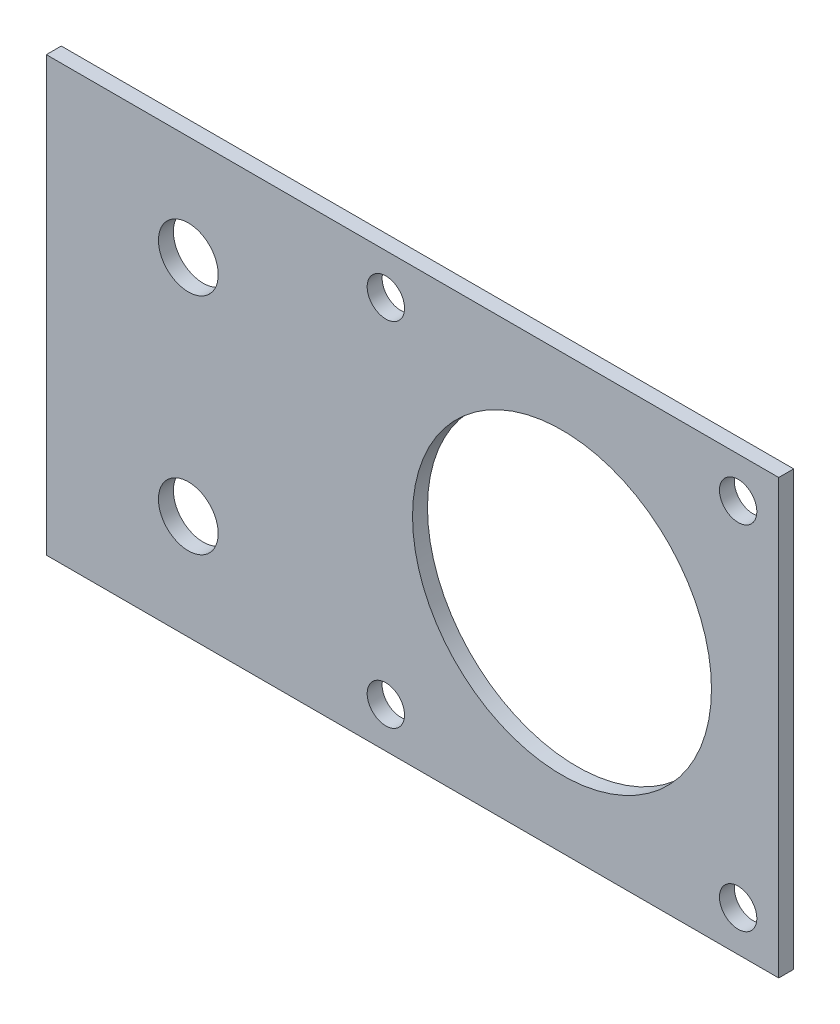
ISO-10303-21;
HEADER;
FILE_DESCRIPTION(('STEP AP214'),'2;1');
FILE_NAME('part.step','',(''),(''),'','','');
FILE_SCHEMA(('AUTOMOTIVE_DESIGN { 1 0 10303 214 1 1 1 1 }'));
ENDSEC;
DATA;
#1=APPLICATION_CONTEXT('core data for automotive mechanical design processes');
#2=APPLICATION_PROTOCOL_DEFINITION('international standard','automotive_design',2000,#1);
#3=PRODUCT_CONTEXT('',#1,'mechanical');
#4=PRODUCT('Part','Part','',(#3));
#5=PRODUCT_RELATED_PRODUCT_CATEGORY('part','',(#4));
#6=PRODUCT_DEFINITION_FORMATION('','',#4);
#7=PRODUCT_DEFINITION_CONTEXT('part definition',#1,'design');
#8=PRODUCT_DEFINITION('design','',#6,#7);
#9=PRODUCT_DEFINITION_SHAPE('','',#8);
#10=(LENGTH_UNIT() NAMED_UNIT(*) SI_UNIT(.MILLI.,.METRE.));
#11=(NAMED_UNIT(*) PLANE_ANGLE_UNIT() SI_UNIT($,.RADIAN.));
#12=(NAMED_UNIT(*) SI_UNIT($,.STERADIAN.) SOLID_ANGLE_UNIT());
#13=UNCERTAINTY_MEASURE_WITH_UNIT(LENGTH_MEASURE(1.E-05),#10,'distance_accuracy_value','');
#14=(GEOMETRIC_REPRESENTATION_CONTEXT(3) GLOBAL_UNCERTAINTY_ASSIGNED_CONTEXT((#13)) GLOBAL_UNIT_ASSIGNED_CONTEXT((#10,
#11,#12)) REPRESENTATION_CONTEXT('',''));
#15=CARTESIAN_POINT('',(0.,0.,0.));
#16=DIRECTION('',(0.,0.,1.));
#17=DIRECTION('',(1.,0.,0.));
#18=AXIS2_PLACEMENT_3D('',#15,#16,#17);
#19=CARTESIAN_POINT('',(-69.,-29.,2.));
#20=DIRECTION('',(0.,0.,1.));
#21=DIRECTION('',(1.,0.,0.));
#22=AXIS2_PLACEMENT_3D('',#19,#20,#21);
#23=PLANE('',#22);
#24=CARTESIAN_POINT('',(-50.,15.,2.));
#25=DIRECTION('',(0.,0.,1.));
#26=DIRECTION('',(1.,0.,0.));
#27=AXIS2_PLACEMENT_3D('',#24,#25,#26);
#28=CIRCLE('',#27,3.99999999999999);
#29=CARTESIAN_POINT('',(-46.,15.,2.));
#30=VERTEX_POINT('',#29);
#31=EDGE_CURVE('E148',#30,#30,#28,.T.);
#32=ORIENTED_EDGE('',*,*,#31,.F.);
#33=EDGE_LOOP('',(#32));
#34=FACE_BOUND('',#33,.T.);
#35=CARTESIAN_POINT('',(-50.,-15.,2.));
#36=DIRECTION('',(0.,0.,1.));
#37=DIRECTION('',(1.,0.,0.));
#38=AXIS2_PLACEMENT_3D('',#35,#36,#37);
#39=CIRCLE('',#38,3.99999999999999);
#40=CARTESIAN_POINT('',(-46.,-15.,2.));
#41=VERTEX_POINT('',#40);
#42=EDGE_CURVE('E142',#41,#41,#39,.T.);
#43=ORIENTED_EDGE('',*,*,#42,.F.);
#44=EDGE_LOOP('',(#43));
#45=FACE_BOUND('',#44,.T.);
#46=CARTESIAN_POINT('',(23.57,23.57,2.));
#47=DIRECTION('',(0.,0.,1.));
#48=DIRECTION('',(1.,0.,0.));
#49=AXIS2_PLACEMENT_3D('',#46,#47,#48);
#50=CIRCLE('',#49,2.5);
#51=CARTESIAN_POINT('',(26.07,23.57,2.));
#52=VERTEX_POINT('',#51);
#53=EDGE_CURVE('E136',#52,#52,#50,.T.);
#54=ORIENTED_EDGE('',*,*,#53,.F.);
#55=EDGE_LOOP('',(#54));
#56=FACE_BOUND('',#55,.T.);
#57=CARTESIAN_POINT('',(-23.57,23.57,2.));
#58=DIRECTION('',(0.,0.,1.));
#59=DIRECTION('',(1.,0.,0.));
#60=AXIS2_PLACEMENT_3D('',#57,#58,#59);
#61=CIRCLE('',#60,2.5);
#62=CARTESIAN_POINT('',(-21.07,23.57,2.));
#63=VERTEX_POINT('',#62);
#64=EDGE_CURVE('E130',#63,#63,#61,.T.);
#65=ORIENTED_EDGE('',*,*,#64,.F.);
#66=EDGE_LOOP('',(#65));
#67=FACE_BOUND('',#66,.T.);
#68=CARTESIAN_POINT('',(23.57,-23.57,2.));
#69=DIRECTION('',(0.,0.,1.));
#70=DIRECTION('',(1.,0.,0.));
#71=AXIS2_PLACEMENT_3D('',#68,#69,#70);
#72=CIRCLE('',#71,2.5);
#73=CARTESIAN_POINT('',(26.07,-23.57,2.));
#74=VERTEX_POINT('',#73);
#75=EDGE_CURVE('E124',#74,#74,#72,.T.);
#76=ORIENTED_EDGE('',*,*,#75,.F.);
#77=EDGE_LOOP('',(#76));
#78=FACE_BOUND('',#77,.T.);
#79=CARTESIAN_POINT('',(-23.57,-23.57,2.));
#80=DIRECTION('',(0.,0.,1.));
#81=DIRECTION('',(1.,0.,0.));
#82=AXIS2_PLACEMENT_3D('',#79,#80,#81);
#83=CIRCLE('',#82,2.5);
#84=CARTESIAN_POINT('',(-21.07,-23.57,2.));
#85=VERTEX_POINT('',#84);
#86=EDGE_CURVE('E118',#85,#85,#83,.T.);
#87=ORIENTED_EDGE('',*,*,#86,.F.);
#88=EDGE_LOOP('',(#87));
#89=FACE_BOUND('',#88,.T.);
#90=DIRECTION('',(0.,-1.,0.));
#91=VECTOR('',#90,1.);
#92=CARTESIAN_POINT('',(-69.,29.,2.));
#93=LINE('',#92,#91);
#94=CARTESIAN_POINT('',(-69.,29.,2.));
#95=VERTEX_POINT('',#94);
#96=CARTESIAN_POINT('',(-69.,-29.,2.));
#97=VERTEX_POINT('',#96);
#98=EDGE_CURVE('E83',#95,#97,#93,.T.);
#99=ORIENTED_EDGE('',*,*,#98,.T.);
#100=DIRECTION('',(1.,0.,0.));
#101=VECTOR('',#100,1.);
#102=CARTESIAN_POINT('',(-69.,-29.,2.));
#103=LINE('',#102,#101);
#104=CARTESIAN_POINT('',(29.,-29.,2.));
#105=VERTEX_POINT('',#104);
#106=EDGE_CURVE('E78',#97,#105,#103,.T.);
#107=ORIENTED_EDGE('',*,*,#106,.T.);
#108=DIRECTION('',(0.,1.,0.));
#109=VECTOR('',#108,1.);
#110=CARTESIAN_POINT('',(29.,29.,2.));
#111=LINE('',#110,#109);
#112=CARTESIAN_POINT('',(29.,29.,2.));
#113=VERTEX_POINT('',#112);
#114=EDGE_CURVE('E81',#105,#113,#111,.T.);
#115=ORIENTED_EDGE('',*,*,#114,.T.);
#116=DIRECTION('',(-1.,0.,0.));
#117=VECTOR('',#116,1.);
#118=CARTESIAN_POINT('',(-69.,29.,2.));
#119=LINE('',#118,#117);
#120=EDGE_CURVE('E48',#113,#95,#119,.T.);
#121=ORIENTED_EDGE('',*,*,#120,.T.);
#122=EDGE_LOOP('',(#99,#107,#115,#121));
#123=FACE_BOUND('',#122,.T.);
#124=CARTESIAN_POINT('',(0.,0.,2.));
#125=DIRECTION('',(0.,0.,1.));
#126=DIRECTION('',(1.,0.,0.));
#127=AXIS2_PLACEMENT_3D('',#124,#125,#126);
#128=CIRCLE('',#127,20.);
#129=CARTESIAN_POINT('',(20.,0.,2.));
#130=VERTEX_POINT('',#129);
#131=EDGE_CURVE('E98',#130,#130,#128,.T.);
#132=ORIENTED_EDGE('',*,*,#131,.F.);
#133=EDGE_LOOP('',(#132));
#134=FACE_BOUND('',#133,.T.);
#135=ADVANCED_FACE('F31',(#34,#45,#56,#67,#78,#89,#123,#134),#23,.T.);
#136=CARTESIAN_POINT('',(-69.,-29.,0.));
#137=DIRECTION('',(0.,0.,1.));
#138=DIRECTION('',(1.,0.,0.));
#139=AXIS2_PLACEMENT_3D('',#136,#137,#138);
#140=PLANE('',#139);
#141=CARTESIAN_POINT('',(-50.,15.,0.));
#142=DIRECTION('',(0.,0.,1.));
#143=DIRECTION('',(1.,0.,0.));
#144=AXIS2_PLACEMENT_3D('',#141,#142,#143);
#145=CIRCLE('',#144,4.);
#146=CARTESIAN_POINT('',(-46.,15.,0.));
#147=VERTEX_POINT('',#146);
#148=EDGE_CURVE('E145',#147,#147,#145,.T.);
#149=ORIENTED_EDGE('',*,*,#148,.T.);
#150=EDGE_LOOP('',(#149));
#151=FACE_BOUND('',#150,.T.);
#152=CARTESIAN_POINT('',(-50.,-15.,0.));
#153=DIRECTION('',(0.,0.,1.));
#154=DIRECTION('',(1.,0.,0.));
#155=AXIS2_PLACEMENT_3D('',#152,#153,#154);
#156=CIRCLE('',#155,4.);
#157=CARTESIAN_POINT('',(-46.,-15.,0.));
#158=VERTEX_POINT('',#157);
#159=EDGE_CURVE('E139',#158,#158,#156,.T.);
#160=ORIENTED_EDGE('',*,*,#159,.T.);
#161=EDGE_LOOP('',(#160));
#162=FACE_BOUND('',#161,.T.);
#163=CARTESIAN_POINT('',(23.57,23.57,0.));
#164=DIRECTION('',(0.,0.,1.));
#165=DIRECTION('',(1.,0.,0.));
#166=AXIS2_PLACEMENT_3D('',#163,#164,#165);
#167=CIRCLE('',#166,2.5);
#168=CARTESIAN_POINT('',(26.07,23.57,0.));
#169=VERTEX_POINT('',#168);
#170=EDGE_CURVE('E133',#169,#169,#167,.T.);
#171=ORIENTED_EDGE('',*,*,#170,.T.);
#172=EDGE_LOOP('',(#171));
#173=FACE_BOUND('',#172,.T.);
#174=CARTESIAN_POINT('',(-23.57,23.57,0.));
#175=DIRECTION('',(0.,0.,1.));
#176=DIRECTION('',(1.,0.,0.));
#177=AXIS2_PLACEMENT_3D('',#174,#175,#176);
#178=CIRCLE('',#177,2.5);
#179=CARTESIAN_POINT('',(-21.07,23.57,0.));
#180=VERTEX_POINT('',#179);
#181=EDGE_CURVE('E127',#180,#180,#178,.T.);
#182=ORIENTED_EDGE('',*,*,#181,.T.);
#183=EDGE_LOOP('',(#182));
#184=FACE_BOUND('',#183,.T.);
#185=CARTESIAN_POINT('',(23.57,-23.57,0.));
#186=DIRECTION('',(0.,0.,1.));
#187=DIRECTION('',(1.,0.,0.));
#188=AXIS2_PLACEMENT_3D('',#185,#186,#187);
#189=CIRCLE('',#188,2.5);
#190=CARTESIAN_POINT('',(26.07,-23.57,0.));
#191=VERTEX_POINT('',#190);
#192=EDGE_CURVE('E121',#191,#191,#189,.T.);
#193=ORIENTED_EDGE('',*,*,#192,.T.);
#194=EDGE_LOOP('',(#193));
#195=FACE_BOUND('',#194,.T.);
#196=CARTESIAN_POINT('',(-23.57,-23.57,0.));
#197=DIRECTION('',(0.,0.,1.));
#198=DIRECTION('',(1.,0.,0.));
#199=AXIS2_PLACEMENT_3D('',#196,#197,#198);
#200=CIRCLE('',#199,2.5);
#201=CARTESIAN_POINT('',(-21.07,-23.57,0.));
#202=VERTEX_POINT('',#201);
#203=EDGE_CURVE('E113',#202,#202,#200,.T.);
#204=ORIENTED_EDGE('',*,*,#203,.T.);
#205=EDGE_LOOP('',(#204));
#206=FACE_BOUND('',#205,.T.);
#207=DIRECTION('',(0.,-1.,0.));
#208=VECTOR('',#207,1.);
#209=CARTESIAN_POINT('',(-69.,29.,0.));
#210=LINE('',#209,#208);
#211=CARTESIAN_POINT('',(-69.,29.,0.));
#212=VERTEX_POINT('',#211);
#213=CARTESIAN_POINT('',(-69.,-29.,0.));
#214=VERTEX_POINT('',#213);
#215=EDGE_CURVE('E95',#212,#214,#210,.T.);
#216=ORIENTED_EDGE('',*,*,#215,.F.);
#217=DIRECTION('',(-1.,0.,0.));
#218=VECTOR('',#217,1.);
#219=CARTESIAN_POINT('',(-69.,29.,0.));
#220=LINE('',#219,#218);
#221=CARTESIAN_POINT('',(29.,29.,0.));
#222=VERTEX_POINT('',#221);
#223=EDGE_CURVE('E71',#222,#212,#220,.T.);
#224=ORIENTED_EDGE('',*,*,#223,.F.);
#225=DIRECTION('',(0.,1.,0.));
#226=VECTOR('',#225,1.);
#227=CARTESIAN_POINT('',(29.,29.,0.));
#228=LINE('',#227,#226);
#229=CARTESIAN_POINT('',(29.,-29.,0.));
#230=VERTEX_POINT('',#229);
#231=EDGE_CURVE('E65',#230,#222,#228,.T.);
#232=ORIENTED_EDGE('',*,*,#231,.F.);
#233=DIRECTION('',(1.,0.,0.));
#234=VECTOR('',#233,1.);
#235=CARTESIAN_POINT('',(-69.,-29.,0.));
#236=LINE('',#235,#234);
#237=EDGE_CURVE('E87',#214,#230,#236,.T.);
#238=ORIENTED_EDGE('',*,*,#237,.F.);
#239=EDGE_LOOP('',(#216,#224,#232,#238));
#240=FACE_BOUND('',#239,.T.);
#241=CARTESIAN_POINT('',(0.,0.,0.));
#242=DIRECTION('',(0.,0.,1.));
#243=DIRECTION('',(1.,0.,0.));
#244=AXIS2_PLACEMENT_3D('',#241,#242,#243);
#245=CIRCLE('',#244,20.);
#246=CARTESIAN_POINT('',(20.,0.,0.));
#247=VERTEX_POINT('',#246);
#248=EDGE_CURVE('E110',#247,#247,#245,.T.);
#249=ORIENTED_EDGE('',*,*,#248,.T.);
#250=EDGE_LOOP('',(#249));
#251=FACE_BOUND('',#250,.T.);
#252=ADVANCED_FACE('F106',(#151,#162,#173,#184,#195,#206,#240,#251),#140,.F.);
#253=CARTESIAN_POINT('',(-69.,29.,2.));
#254=DIRECTION('',(1.,0.,0.));
#255=DIRECTION('',(0.,0.,-1.));
#256=AXIS2_PLACEMENT_3D('',#253,#254,#255);
#257=PLANE('',#256);
#258=ORIENTED_EDGE('',*,*,#215,.T.);
#259=DIRECTION('',(0.,0.,-1.));
#260=VECTOR('',#259,1.);
#261=CARTESIAN_POINT('',(-69.,-29.,2.));
#262=LINE('',#261,#260);
#263=EDGE_CURVE('E11',#97,#214,#262,.T.);
#264=ORIENTED_EDGE('',*,*,#263,.F.);
#265=ORIENTED_EDGE('',*,*,#98,.F.);
#266=DIRECTION('',(0.,0.,-1.));
#267=VECTOR('',#266,1.);
#268=CARTESIAN_POINT('',(-69.,29.,2.));
#269=LINE('',#268,#267);
#270=EDGE_CURVE('E91',#95,#212,#269,.T.);
#271=ORIENTED_EDGE('',*,*,#270,.T.);
#272=EDGE_LOOP('',(#258,#264,#265,#271));
#273=FACE_BOUND('',#272,.T.);
#274=ADVANCED_FACE('F33',(#273),#257,.F.);
#275=CARTESIAN_POINT('',(-69.,-29.,2.));
#276=DIRECTION('',(0.,1.,0.));
#277=DIRECTION('',(0.,0.,1.));
#278=AXIS2_PLACEMENT_3D('',#275,#276,#277);
#279=PLANE('',#278);
#280=ORIENTED_EDGE('',*,*,#237,.T.);
#281=DIRECTION('',(0.,0.,-1.));
#282=VECTOR('',#281,1.);
#283=CARTESIAN_POINT('',(29.,-29.,2.));
#284=LINE('',#283,#282);
#285=EDGE_CURVE('E40',#105,#230,#284,.T.);
#286=ORIENTED_EDGE('',*,*,#285,.F.);
#287=ORIENTED_EDGE('',*,*,#106,.F.);
#288=ORIENTED_EDGE('',*,*,#263,.T.);
#289=EDGE_LOOP('',(#280,#286,#287,#288));
#290=FACE_BOUND('',#289,.T.);
#291=ADVANCED_FACE('F86',(#290),#279,.F.);
#292=CARTESIAN_POINT('',(29.,29.,2.));
#293=DIRECTION('',(-1.,0.,0.));
#294=DIRECTION('',(0.,-1.,0.));
#295=AXIS2_PLACEMENT_3D('',#292,#293,#294);
#296=PLANE('',#295);
#297=ORIENTED_EDGE('',*,*,#231,.T.);
#298=DIRECTION('',(0.,0.,-1.));
#299=VECTOR('',#298,1.);
#300=CARTESIAN_POINT('',(29.,29.,2.));
#301=LINE('',#300,#299);
#302=EDGE_CURVE('E88',#113,#222,#301,.T.);
#303=ORIENTED_EDGE('',*,*,#302,.F.);
#304=ORIENTED_EDGE('',*,*,#114,.F.);
#305=ORIENTED_EDGE('',*,*,#285,.T.);
#306=EDGE_LOOP('',(#297,#303,#304,#305));
#307=FACE_BOUND('',#306,.T.);
#308=ADVANCED_FACE('F89',(#307),#296,.F.);
#309=CARTESIAN_POINT('',(-69.,29.,2.));
#310=DIRECTION('',(0.,-1.,0.));
#311=DIRECTION('',(0.,0.,-1.));
#312=AXIS2_PLACEMENT_3D('',#309,#310,#311);
#313=PLANE('',#312);
#314=ORIENTED_EDGE('',*,*,#223,.T.);
#315=ORIENTED_EDGE('',*,*,#270,.F.);
#316=ORIENTED_EDGE('',*,*,#120,.F.);
#317=ORIENTED_EDGE('',*,*,#302,.T.);
#318=EDGE_LOOP('',(#314,#315,#316,#317));
#319=FACE_BOUND('',#318,.T.);
#320=ADVANCED_FACE('F103',(#319),#313,.F.);
#321=CARTESIAN_POINT('',(0.,0.,2.));
#322=DIRECTION('',(0.,0.,-1.));
#323=DIRECTION('',(-1.,0.,0.));
#324=AXIS2_PLACEMENT_3D('',#321,#322,#323);
#325=CYLINDRICAL_SURFACE('',#324,20.);
#326=ORIENTED_EDGE('',*,*,#131,.T.);
#327=EDGE_LOOP('',(#326));
#328=FACE_BOUND('',#327,.T.);
#329=ORIENTED_EDGE('',*,*,#248,.F.);
#330=EDGE_LOOP('',(#329));
#331=FACE_BOUND('',#330,.T.);
#332=ADVANCED_FACE('F170',(#328,#331),#325,.F.);
#333=CARTESIAN_POINT('',(-23.57,-23.57,2.));
#334=DIRECTION('',(0.,0.,1.));
#335=DIRECTION('',(1.,0.,0.));
#336=AXIS2_PLACEMENT_3D('',#333,#334,#335);
#337=CYLINDRICAL_SURFACE('',#336,2.5);
#338=ORIENTED_EDGE('',*,*,#203,.F.);
#339=EDGE_LOOP('',(#338));
#340=FACE_BOUND('',#339,.T.);
#341=ORIENTED_EDGE('',*,*,#86,.T.);
#342=EDGE_LOOP('',(#341));
#343=FACE_BOUND('',#342,.T.);
#344=ADVANCED_FACE('F167',(#340,#343),#337,.F.);
#345=CARTESIAN_POINT('',(23.57,-23.57,2.));
#346=DIRECTION('',(0.,0.,1.));
#347=DIRECTION('',(1.,0.,0.));
#348=AXIS2_PLACEMENT_3D('',#345,#346,#347);
#349=CYLINDRICAL_SURFACE('',#348,2.5);
#350=ORIENTED_EDGE('',*,*,#192,.F.);
#351=EDGE_LOOP('',(#350));
#352=FACE_BOUND('',#351,.T.);
#353=ORIENTED_EDGE('',*,*,#75,.T.);
#354=EDGE_LOOP('',(#353));
#355=FACE_BOUND('',#354,.T.);
#356=ADVANCED_FACE('F169',(#352,#355),#349,.F.);
#357=CARTESIAN_POINT('',(-23.57,23.57,2.));
#358=DIRECTION('',(0.,0.,1.));
#359=DIRECTION('',(1.,0.,0.));
#360=AXIS2_PLACEMENT_3D('',#357,#358,#359);
#361=CYLINDRICAL_SURFACE('',#360,2.5);
#362=ORIENTED_EDGE('',*,*,#181,.F.);
#363=EDGE_LOOP('',(#362));
#364=FACE_BOUND('',#363,.T.);
#365=ORIENTED_EDGE('',*,*,#64,.T.);
#366=EDGE_LOOP('',(#365));
#367=FACE_BOUND('',#366,.T.);
#368=ADVANCED_FACE('F177',(#364,#367),#361,.F.);
#369=CARTESIAN_POINT('',(23.57,23.57,2.));
#370=DIRECTION('',(0.,0.,1.));
#371=DIRECTION('',(1.,0.,0.));
#372=AXIS2_PLACEMENT_3D('',#369,#370,#371);
#373=CYLINDRICAL_SURFACE('',#372,2.5);
#374=ORIENTED_EDGE('',*,*,#170,.F.);
#375=EDGE_LOOP('',(#374));
#376=FACE_BOUND('',#375,.T.);
#377=ORIENTED_EDGE('',*,*,#53,.T.);
#378=EDGE_LOOP('',(#377));
#379=FACE_BOUND('',#378,.T.);
#380=ADVANCED_FACE('F211',(#376,#379),#373,.F.);
#381=CARTESIAN_POINT('',(-50.,-15.,2.));
#382=DIRECTION('',(0.,0.,1.));
#383=DIRECTION('',(1.,0.,0.));
#384=AXIS2_PLACEMENT_3D('',#381,#382,#383);
#385=CYLINDRICAL_SURFACE('',#384,3.99999999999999);
#386=ORIENTED_EDGE('',*,*,#159,.F.);
#387=EDGE_LOOP('',(#386));
#388=FACE_BOUND('',#387,.T.);
#389=ORIENTED_EDGE('',*,*,#42,.T.);
#390=EDGE_LOOP('',(#389));
#391=FACE_BOUND('',#390,.T.);
#392=ADVANCED_FACE('F216',(#388,#391),#385,.F.);
#393=CARTESIAN_POINT('',(-50.,15.,2.));
#394=DIRECTION('',(0.,0.,1.));
#395=DIRECTION('',(1.,0.,0.));
#396=AXIS2_PLACEMENT_3D('',#393,#394,#395);
#397=CYLINDRICAL_SURFACE('',#396,3.99999999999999);
#398=ORIENTED_EDGE('',*,*,#148,.F.);
#399=EDGE_LOOP('',(#398));
#400=FACE_BOUND('',#399,.T.);
#401=ORIENTED_EDGE('',*,*,#31,.T.);
#402=EDGE_LOOP('',(#401));
#403=FACE_BOUND('',#402,.T.);
#404=ADVANCED_FACE('F152',(#400,#403),#397,.F.);
#405=CLOSED_SHELL('',(#135,#252,#274,#291,#308,#320,#332,#344,#356,#368,#380,#392,#404));
#406=MANIFOLD_SOLID_BREP('B2',#405);
#407=ADVANCED_BREP_SHAPE_REPRESENTATION('',(#18,#406),#14);
#408=SHAPE_DEFINITION_REPRESENTATION(#9,#407);
ENDSEC;
END-ISO-10303-21;
